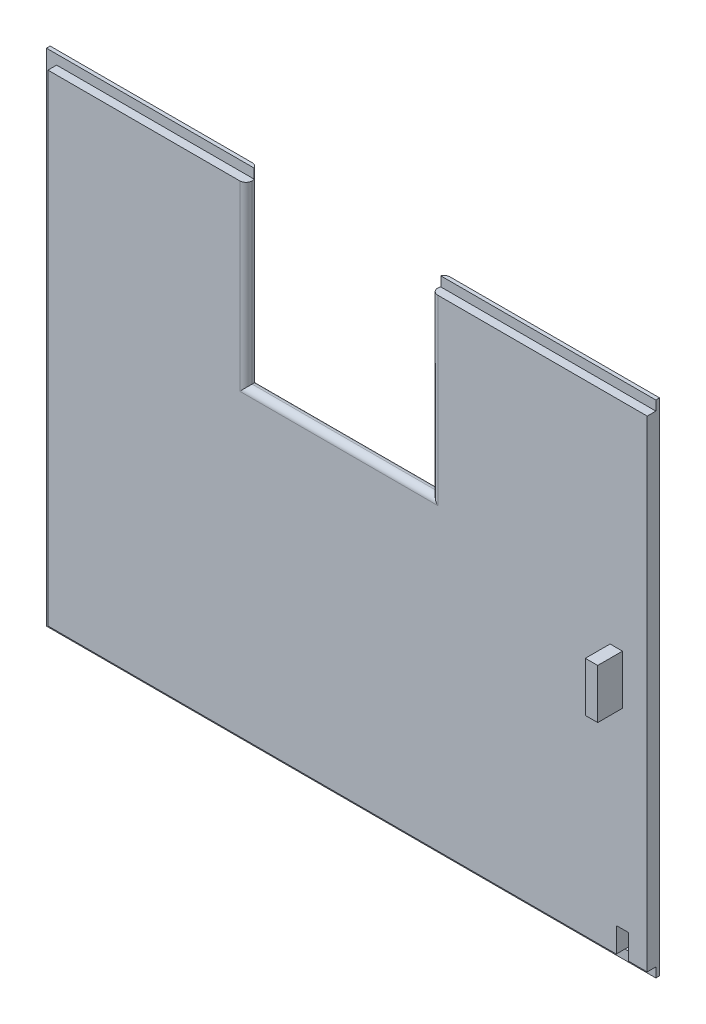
ISO-10303-21;
HEADER;
FILE_DESCRIPTION(('STEP AP214'),'2;1');
FILE_NAME('part.step','',(''),(''),'','','');
FILE_SCHEMA(('AUTOMOTIVE_DESIGN { 1 0 10303 214 1 1 1 1 }'));
ENDSEC;
DATA;
#1=APPLICATION_CONTEXT('core data for automotive mechanical design processes');
#2=APPLICATION_PROTOCOL_DEFINITION('international standard','automotive_design',2000,#1);
#3=PRODUCT_CONTEXT('',#1,'mechanical');
#4=PRODUCT('Part','Part','',(#3));
#5=PRODUCT_RELATED_PRODUCT_CATEGORY('part','',(#4));
#6=PRODUCT_DEFINITION_FORMATION('','',#4);
#7=PRODUCT_DEFINITION_CONTEXT('part definition',#1,'design');
#8=PRODUCT_DEFINITION('design','',#6,#7);
#9=PRODUCT_DEFINITION_SHAPE('','',#8);
#10=(LENGTH_UNIT() NAMED_UNIT(*) SI_UNIT(.MILLI.,.METRE.));
#11=(NAMED_UNIT(*) PLANE_ANGLE_UNIT() SI_UNIT($,.RADIAN.));
#12=(NAMED_UNIT(*) SI_UNIT($,.STERADIAN.) SOLID_ANGLE_UNIT());
#13=UNCERTAINTY_MEASURE_WITH_UNIT(LENGTH_MEASURE(1.E-05),#10,'distance_accuracy_value','');
#14=(GEOMETRIC_REPRESENTATION_CONTEXT(3) GLOBAL_UNCERTAINTY_ASSIGNED_CONTEXT((#13)) GLOBAL_UNIT_ASSIGNED_CONTEXT((#10,
#11,#12)) REPRESENTATION_CONTEXT('',''));
#15=CARTESIAN_POINT('',(0.,0.,0.));
#16=DIRECTION('',(0.,0.,1.));
#17=DIRECTION('',(1.,0.,0.));
#18=AXIS2_PLACEMENT_3D('',#15,#16,#17);
#19=CARTESIAN_POINT('',(-0.001000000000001,1.55,2.));
#20=DIRECTION('',(0.,1.,0.));
#21=DIRECTION('',(0.,0.,1.));
#22=AXIS2_PLACEMENT_3D('',#19,#20,#21);
#23=PLANE('',#22);
#24=DIRECTION('',(1.,0.,0.));
#25=VECTOR('',#24,1.);
#26=CARTESIAN_POINT('',(-0.001000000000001,1.55,0.6));
#27=LINE('',#26,#25);
#28=CARTESIAN_POINT('',(1.65,1.55,0.6));
#29=VERTEX_POINT('',#28);
#30=CARTESIAN_POINT('',(93.5,1.55,0.6));
#31=VERTEX_POINT('',#30);
#32=EDGE_CURVE('E385',#29,#31,#27,.T.);
#33=ORIENTED_EDGE('',*,*,#32,.T.);
#34=DIRECTION('',(0.,0.,1.));
#35=VECTOR('',#34,1.);
#36=CARTESIAN_POINT('',(93.5,1.55,2.));
#37=LINE('',#36,#35);
#38=CARTESIAN_POINT('',(93.5,1.55,2.));
#39=VERTEX_POINT('',#38);
#40=EDGE_CURVE('E429',#31,#39,#37,.T.);
#41=ORIENTED_EDGE('',*,*,#40,.T.);
#42=DIRECTION('',(1.,0.,0.));
#43=VECTOR('',#42,1.);
#44=CARTESIAN_POINT('',(-0.001000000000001,1.55,2.));
#45=LINE('',#44,#43);
#46=CARTESIAN_POINT('',(1.65,1.55,2.));
#47=VERTEX_POINT('',#46);
#48=EDGE_CURVE('E356',#47,#39,#45,.T.);
#49=ORIENTED_EDGE('',*,*,#48,.F.);
#50=DIRECTION('',(0.,0.,1.));
#51=VECTOR('',#50,1.);
#52=CARTESIAN_POINT('',(1.65,1.55,2.));
#53=LINE('',#52,#51);
#54=EDGE_CURVE('E339',#29,#47,#53,.T.);
#55=ORIENTED_EDGE('',*,*,#54,.F.);
#56=EDGE_LOOP('',(#33,#41,#49,#55));
#57=FACE_BOUND('',#56,.T.);
#58=ADVANCED_FACE('F39',(#57),#23,.F.);
#59=CARTESIAN_POINT('',(0.,80.9,2.));
#60=DIRECTION('',(0.,-1.,0.));
#61=DIRECTION('',(0.,0.,-1.));
#62=AXIS2_PLACEMENT_3D('',#59,#60,#61);
#63=PLANE('',#62);
#64=DIRECTION('',(1.,0.,0.));
#65=VECTOR('',#64,1.);
#66=CARTESIAN_POINT('',(-0.001000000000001,80.9,0.6));
#67=LINE('',#66,#65);
#68=CARTESIAN_POINT('',(0.,80.9,0.6));
#69=VERTEX_POINT('',#68);
#70=CARTESIAN_POINT('',(33.5665151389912,80.9,0.6));
#71=VERTEX_POINT('',#70);
#72=EDGE_CURVE('E363',#69,#71,#67,.T.);
#73=ORIENTED_EDGE('',*,*,#72,.T.);
#74=CARTESIAN_POINT('',(32.65,80.9,1.));
#75=DIRECTION('',(0.,-1.,0.));
#76=DIRECTION('',(0.,0.,-1.));
#77=AXIS2_PLACEMENT_3D('',#74,#75,#76);
#78=CIRCLE('',#77,1.);
#79=CARTESIAN_POINT('',(32.65,80.9,0.));
#80=VERTEX_POINT('',#79);
#81=EDGE_CURVE('E441',#71,#80,#78,.F.);
#82=ORIENTED_EDGE('',*,*,#81,.T.);
#83=DIRECTION('',(-1.,0.,0.));
#84=VECTOR('',#83,1.);
#85=CARTESIAN_POINT('',(0.,80.9,0.));
#86=LINE('',#85,#84);
#87=CARTESIAN_POINT('',(0.,80.9,0.));
#88=VERTEX_POINT('',#87);
#89=EDGE_CURVE('E410',#80,#88,#86,.T.);
#90=ORIENTED_EDGE('',*,*,#89,.T.);
#91=DIRECTION('',(0.,0.,-1.));
#92=VECTOR('',#91,1.);
#93=CARTESIAN_POINT('',(0.,80.9,2.));
#94=LINE('',#93,#92);
#95=EDGE_CURVE('E397',#69,#88,#94,.T.);
#96=ORIENTED_EDGE('',*,*,#95,.F.);
#97=EDGE_LOOP('',(#73,#82,#90,#96));
#98=FACE_BOUND('',#97,.T.);
#99=ADVANCED_FACE('F517',(#98),#63,.F.);
#100=CARTESIAN_POINT('',(-0.001000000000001,80.9,0.6));
#101=DIRECTION('',(0.,0.,-1.));
#102=DIRECTION('',(0.,1.,0.));
#103=AXIS2_PLACEMENT_3D('',#100,#101,#102);
#104=PLANE('',#103);
#105=DIRECTION('',(1.,0.,0.));
#106=VECTOR('',#105,1.);
#107=CARTESIAN_POINT('',(-0.001000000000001,79.35,0.6));
#108=LINE('',#107,#106);
#109=CARTESIAN_POINT('',(1.65,79.35,0.6));
#110=VERTEX_POINT('',#109);
#111=CARTESIAN_POINT('',(33.5665151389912,79.35,0.6));
#112=VERTEX_POINT('',#111);
#113=EDGE_CURVE('E227',#110,#112,#108,.T.);
#114=ORIENTED_EDGE('',*,*,#113,.T.);
#115=DIRECTION('',(0.,-1.,0.));
#116=VECTOR('',#115,1.);
#117=CARTESIAN_POINT('',(33.5665151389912,79.35,0.6));
#118=LINE('',#117,#116);
#119=EDGE_CURVE('E438',#112,#71,#118,.F.);
#120=ORIENTED_EDGE('',*,*,#119,.T.);
#121=ORIENTED_EDGE('',*,*,#72,.F.);
#122=DIRECTION('',(0.,-1.,0.));
#123=VECTOR('',#122,1.);
#124=CARTESIAN_POINT('',(0.,80.9,0.6));
#125=LINE('',#124,#123);
#126=CARTESIAN_POINT('',(0.,0.,0.6));
#127=VERTEX_POINT('',#126);
#128=EDGE_CURVE('E353',#69,#127,#125,.T.);
#129=ORIENTED_EDGE('',*,*,#128,.T.);
#130=DIRECTION('',(1.,0.,0.));
#131=VECTOR('',#130,1.);
#132=CARTESIAN_POINT('',(-0.001000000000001,0.,0.6));
#133=LINE('',#132,#131);
#134=CARTESIAN_POINT('',(98.5,0.,0.6));
#135=VERTEX_POINT('',#134);
#136=EDGE_CURVE('E380',#127,#135,#133,.T.);
#137=ORIENTED_EDGE('',*,*,#136,.T.);
#138=DIRECTION('',(0.,1.,0.));
#139=VECTOR('',#138,1.);
#140=CARTESIAN_POINT('',(98.5,0.,0.6));
#141=LINE('',#140,#139);
#142=CARTESIAN_POINT('',(98.5,1.55,0.6));
#143=VERTEX_POINT('',#142);
#144=EDGE_CURVE('E350',#135,#143,#141,.T.);
#145=ORIENTED_EDGE('',*,*,#144,.T.);
#146=CARTESIAN_POINT('',(95.5,1.55,0.6));
#147=VERTEX_POINT('',#146);
#148=EDGE_CURVE('E390',#147,#143,#27,.T.);
#149=ORIENTED_EDGE('',*,*,#148,.F.);
#150=EDGE_CURVE('E389',#31,#147,#27,.T.);
#151=ORIENTED_EDGE('',*,*,#150,.F.);
#152=ORIENTED_EDGE('',*,*,#32,.F.);
#153=DIRECTION('',(0.,1.,0.));
#154=VECTOR('',#153,1.);
#155=CARTESIAN_POINT('',(1.65,-0.001000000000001,0.6));
#156=LINE('',#155,#154);
#157=EDGE_CURVE('E347',#29,#110,#156,.T.);
#158=ORIENTED_EDGE('',*,*,#157,.T.);
#159=EDGE_LOOP('',(#114,#120,#121,#129,#137,#145,#149,#151,#152,#158));
#160=FACE_BOUND('',#159,.T.);
#161=ADVANCED_FACE('F494',(#160),#104,.F.);
#162=CARTESIAN_POINT('',(-0.001000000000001,79.35,2.));
#163=DIRECTION('',(0.,-1.,0.));
#164=DIRECTION('',(0.,0.,-1.));
#165=AXIS2_PLACEMENT_3D('',#162,#163,#164);
#166=PLANE('',#165);
#167=CARTESIAN_POINT('',(32.65,79.35,1.));
#168=DIRECTION('',(0.,-1.,0.));
#169=DIRECTION('',(0.,0.,-1.));
#170=AXIS2_PLACEMENT_3D('',#167,#168,#169);
#171=CIRCLE('',#170,1.);
#172=CARTESIAN_POINT('',(32.65,79.35,2.));
#173=VERTEX_POINT('',#172);
#174=CARTESIAN_POINT('',(33.65,79.35,1.));
#175=VERTEX_POINT('',#174);
#176=EDGE_CURVE('E432',#173,#175,#171,.F.);
#177=ORIENTED_EDGE('',*,*,#176,.T.);
#178=CARTESIAN_POINT('',(32.65,79.35,1.));
#179=DIRECTION('',(0.,-1.,0.));
#180=DIRECTION('',(0.,0.,-1.));
#181=AXIS2_PLACEMENT_3D('',#178,#179,#180);
#182=CIRCLE('',#181,1.);
#183=EDGE_CURVE('E435',#175,#112,#182,.F.);
#184=ORIENTED_EDGE('',*,*,#183,.T.);
#185=ORIENTED_EDGE('',*,*,#113,.F.);
#186=DIRECTION('',(0.,0.,-1.));
#187=VECTOR('',#186,1.);
#188=CARTESIAN_POINT('',(1.65,79.35,2.));
#189=LINE('',#188,#187);
#190=CARTESIAN_POINT('',(1.65,79.35,2.));
#191=VERTEX_POINT('',#190);
#192=EDGE_CURVE('E342',#191,#110,#189,.T.);
#193=ORIENTED_EDGE('',*,*,#192,.F.);
#194=DIRECTION('',(1.,0.,0.));
#195=VECTOR('',#194,1.);
#196=CARTESIAN_POINT('',(-0.001000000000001,79.35,2.));
#197=LINE('',#196,#195);
#198=EDGE_CURVE('E228',#191,#173,#197,.T.);
#199=ORIENTED_EDGE('',*,*,#198,.T.);
#200=EDGE_LOOP('',(#177,#184,#185,#193,#199));
#201=FACE_BOUND('',#200,.T.);
#202=ADVANCED_FACE('F472',(#201),#166,.F.);
#203=CARTESIAN_POINT('',(0.,0.,2.));
#204=DIRECTION('',(1.,0.,0.));
#205=DIRECTION('',(0.,0.,-1.));
#206=AXIS2_PLACEMENT_3D('',#203,#204,#205);
#207=PLANE('',#206);
#208=DIRECTION('',(0.,0.,-1.));
#209=VECTOR('',#208,1.);
#210=CARTESIAN_POINT('',(0.,0.,2.));
#211=LINE('',#210,#209);
#212=CARTESIAN_POINT('',(0.,0.,0.));
#213=VERTEX_POINT('',#212);
#214=EDGE_CURVE('E422',#127,#213,#211,.T.);
#215=ORIENTED_EDGE('',*,*,#214,.F.);
#216=ORIENTED_EDGE('',*,*,#128,.F.);
#217=ORIENTED_EDGE('',*,*,#95,.T.);
#218=DIRECTION('',(0.,-1.,0.));
#219=VECTOR('',#218,1.);
#220=CARTESIAN_POINT('',(0.,0.,0.));
#221=LINE('',#220,#219);
#222=EDGE_CURVE('E366',#88,#213,#221,.T.);
#223=ORIENTED_EDGE('',*,*,#222,.T.);
#224=EDGE_LOOP('',(#215,#216,#217,#223));
#225=FACE_BOUND('',#224,.T.);
#226=ADVANCED_FACE('F525',(#225),#207,.F.);
#227=CARTESIAN_POINT('',(0.,0.,2.));
#228=DIRECTION('',(0.,1.,0.));
#229=DIRECTION('',(0.,0.,1.));
#230=AXIS2_PLACEMENT_3D('',#227,#228,#229);
#231=PLANE('',#230);
#232=DIRECTION('',(0.,0.,-1.));
#233=VECTOR('',#232,1.);
#234=CARTESIAN_POINT('',(98.5,0.,2.));
#235=LINE('',#234,#233);
#236=CARTESIAN_POINT('',(98.5,0.,0.));
#237=VERTEX_POINT('',#236);
#238=EDGE_CURVE('E419',#135,#237,#235,.T.);
#239=ORIENTED_EDGE('',*,*,#238,.F.);
#240=ORIENTED_EDGE('',*,*,#136,.F.);
#241=ORIENTED_EDGE('',*,*,#214,.T.);
#242=DIRECTION('',(1.,0.,0.));
#243=VECTOR('',#242,1.);
#244=CARTESIAN_POINT('',(0.,0.,0.));
#245=LINE('',#244,#243);
#246=EDGE_CURVE('E402',#213,#237,#245,.T.);
#247=ORIENTED_EDGE('',*,*,#246,.T.);
#248=EDGE_LOOP('',(#239,#240,#241,#247));
#249=FACE_BOUND('',#248,.T.);
#250=ADVANCED_FACE('F532',(#249),#231,.F.);
#251=CARTESIAN_POINT('',(98.5,0.,2.));
#252=DIRECTION('',(-1.,0.,0.));
#253=DIRECTION('',(0.,0.,1.));
#254=AXIS2_PLACEMENT_3D('',#251,#252,#253);
#255=PLANE('',#254);
#256=DIRECTION('',(0.,0.,-1.));
#257=VECTOR('',#256,1.);
#258=CARTESIAN_POINT('',(98.5,80.9,2.));
#259=LINE('',#258,#257);
#260=CARTESIAN_POINT('',(98.5,80.9,0.6));
#261=VERTEX_POINT('',#260);
#262=CARTESIAN_POINT('',(98.5,80.9,0.));
#263=VERTEX_POINT('',#262);
#264=EDGE_CURVE('E416',#261,#263,#259,.T.);
#265=ORIENTED_EDGE('',*,*,#264,.F.);
#266=DIRECTION('',(0.,1.,0.));
#267=VECTOR('',#266,1.);
#268=CARTESIAN_POINT('',(98.5,80.9,0.6));
#269=LINE('',#268,#267);
#270=CARTESIAN_POINT('',(98.5,79.35,0.6));
#271=VERTEX_POINT('',#270);
#272=EDGE_CURVE('E359',#271,#261,#269,.T.);
#273=ORIENTED_EDGE('',*,*,#272,.F.);
#274=DIRECTION('',(0.,0.,-1.));
#275=VECTOR('',#274,1.);
#276=CARTESIAN_POINT('',(98.5,79.35,2.));
#277=LINE('',#276,#275);
#278=CARTESIAN_POINT('',(98.5,79.35,2.));
#279=VERTEX_POINT('',#278);
#280=EDGE_CURVE('E224',#279,#271,#277,.T.);
#281=ORIENTED_EDGE('',*,*,#280,.F.);
#282=DIRECTION('',(0.,1.,0.));
#283=VECTOR('',#282,1.);
#284=CARTESIAN_POINT('',(98.5,0.,2.));
#285=LINE('',#284,#283);
#286=CARTESIAN_POINT('',(98.5,1.55,2.));
#287=VERTEX_POINT('',#286);
#288=EDGE_CURVE('E393',#287,#279,#285,.T.);
#289=ORIENTED_EDGE('',*,*,#288,.F.);
#290=DIRECTION('',(0.,0.,1.));
#291=VECTOR('',#290,1.);
#292=CARTESIAN_POINT('',(98.5,1.55,2.));
#293=LINE('',#292,#291);
#294=EDGE_CURVE('E376',#143,#287,#293,.T.);
#295=ORIENTED_EDGE('',*,*,#294,.F.);
#296=ORIENTED_EDGE('',*,*,#144,.F.);
#297=ORIENTED_EDGE('',*,*,#238,.T.);
#298=DIRECTION('',(0.,1.,0.));
#299=VECTOR('',#298,1.);
#300=CARTESIAN_POINT('',(98.5,0.,0.));
#301=LINE('',#300,#299);
#302=EDGE_CURVE('E406',#237,#263,#301,.T.);
#303=ORIENTED_EDGE('',*,*,#302,.T.);
#304=EDGE_LOOP('',(#265,#273,#281,#289,#295,#296,#297,#303));
#305=FACE_BOUND('',#304,.T.);
#306=ADVANCED_FACE('F507',(#305),#255,.F.);
#307=CARTESIAN_POINT('',(64.65,80.9,0.));
#308=VERTEX_POINT('',#307);
#309=EDGE_CURVE('E398',#263,#308,#86,.T.);
#310=ORIENTED_EDGE('',*,*,#309,.T.);
#311=CARTESIAN_POINT('',(64.65,80.9,1.));
#312=DIRECTION('',(0.,-1.,0.));
#313=DIRECTION('',(0.,0.,-1.));
#314=AXIS2_PLACEMENT_3D('',#311,#312,#313);
#315=CIRCLE('',#314,1.);
#316=CARTESIAN_POINT('',(63.7334848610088,80.9,0.6));
#317=VERTEX_POINT('',#316);
#318=EDGE_CURVE('E50',#308,#317,#315,.F.);
#319=ORIENTED_EDGE('',*,*,#318,.T.);
#320=EDGE_CURVE('E217',#317,#261,#67,.T.);
#321=ORIENTED_EDGE('',*,*,#320,.T.);
#322=ORIENTED_EDGE('',*,*,#264,.T.);
#323=EDGE_LOOP('',(#310,#319,#321,#322));
#324=FACE_BOUND('',#323,.T.);
#325=ADVANCED_FACE('F534',(#324),#63,.F.);
#326=CARTESIAN_POINT('',(0.,0.,2.));
#327=DIRECTION('',(0.,0.,-1.));
#328=DIRECTION('',(-1.,0.,0.));
#329=AXIS2_PLACEMENT_3D('',#326,#327,#328);
#330=PLANE('',#329);
#331=DIRECTION('',(1.,0.,0.));
#332=VECTOR('',#331,1.);
#333=CARTESIAN_POINT('',(0.,44.45,2.));
#334=LINE('',#333,#332);
#335=CARTESIAN_POINT('',(92.5,44.45,2.));
#336=VERTEX_POINT('',#335);
#337=CARTESIAN_POINT('',(94.5,44.45,2.));
#338=VERTEX_POINT('',#337);
#339=EDGE_CURVE('E331',#336,#338,#334,.T.);
#340=ORIENTED_EDGE('',*,*,#339,.T.);
#341=DIRECTION('',(0.,-1.,0.));
#342=VECTOR('',#341,1.);
#343=CARTESIAN_POINT('',(94.5,0.,2.));
#344=LINE('',#343,#342);
#345=CARTESIAN_POINT('',(94.5,36.45,2.));
#346=VERTEX_POINT('',#345);
#347=EDGE_CURVE('E335',#338,#346,#344,.T.);
#348=ORIENTED_EDGE('',*,*,#347,.T.);
#349=DIRECTION('',(-1.,0.,0.));
#350=VECTOR('',#349,1.);
#351=CARTESIAN_POINT('',(0.,36.45,2.));
#352=LINE('',#351,#350);
#353=CARTESIAN_POINT('',(92.5,36.45,2.));
#354=VERTEX_POINT('',#353);
#355=EDGE_CURVE('E313',#346,#354,#352,.T.);
#356=ORIENTED_EDGE('',*,*,#355,.T.);
#357=DIRECTION('',(0.,1.,0.));
#358=VECTOR('',#357,1.);
#359=CARTESIAN_POINT('',(92.5,0.,2.));
#360=LINE('',#359,#358);
#361=EDGE_CURVE('E327',#354,#336,#360,.T.);
#362=ORIENTED_EDGE('',*,*,#361,.T.);
#363=EDGE_LOOP('',(#340,#348,#356,#362));
#364=FACE_BOUND('',#363,.T.);
#365=DIRECTION('',(1.,0.,0.));
#366=VECTOR('',#365,1.);
#367=CARTESIAN_POINT('',(33.65,49.9,2.));
#368=LINE('',#367,#366);
#369=CARTESIAN_POINT('',(64.65,49.9,2.));
#370=VERTEX_POINT('',#369);
#371=CARTESIAN_POINT('',(32.65,49.9,2.));
#372=VERTEX_POINT('',#371);
#373=EDGE_CURVE('E454',#370,#372,#368,.F.);
#374=ORIENTED_EDGE('',*,*,#373,.T.);
#375=DIRECTION('',(0.,1.,0.));
#376=VECTOR('',#375,1.);
#377=CARTESIAN_POINT('',(32.65,0.,2.));
#378=LINE('',#377,#376);
#379=EDGE_CURVE('E234',#372,#173,#378,.T.);
#380=ORIENTED_EDGE('',*,*,#379,.T.);
#381=ORIENTED_EDGE('',*,*,#198,.F.);
#382=DIRECTION('',(0.,1.,0.));
#383=VECTOR('',#382,1.);
#384=CARTESIAN_POINT('',(1.65,-0.001000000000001,2.));
#385=LINE('',#384,#383);
#386=EDGE_CURVE('E346',#47,#191,#385,.T.);
#387=ORIENTED_EDGE('',*,*,#386,.F.);
#388=ORIENTED_EDGE('',*,*,#48,.T.);
#389=DIRECTION('',(0.,-1.,0.));
#390=VECTOR('',#389,1.);
#391=CARTESIAN_POINT('',(93.5,1.55,2.));
#392=LINE('',#391,#390);
#393=CARTESIAN_POINT('',(93.5,5.55,2.));
#394=VERTEX_POINT('',#393);
#395=EDGE_CURVE('E85',#394,#39,#392,.T.);
#396=ORIENTED_EDGE('',*,*,#395,.F.);
#397=DIRECTION('',(-1.,0.,0.));
#398=VECTOR('',#397,1.);
#399=CARTESIAN_POINT('',(93.5,5.55,2.));
#400=LINE('',#399,#398);
#401=CARTESIAN_POINT('',(95.5,5.55,2.));
#402=VERTEX_POINT('',#401);
#403=EDGE_CURVE('E269',#402,#394,#400,.T.);
#404=ORIENTED_EDGE('',*,*,#403,.F.);
#405=DIRECTION('',(0.,1.,0.));
#406=VECTOR('',#405,1.);
#407=CARTESIAN_POINT('',(95.5,1.55,2.));
#408=LINE('',#407,#406);
#409=CARTESIAN_POINT('',(95.5,1.55,2.));
#410=VERTEX_POINT('',#409);
#411=EDGE_CURVE('E265',#410,#402,#408,.T.);
#412=ORIENTED_EDGE('',*,*,#411,.F.);
#413=EDGE_CURVE('E384',#410,#287,#45,.T.);
#414=ORIENTED_EDGE('',*,*,#413,.T.);
#415=ORIENTED_EDGE('',*,*,#288,.T.);
#416=CARTESIAN_POINT('',(64.65,79.35,2.));
#417=VERTEX_POINT('',#416);
#418=EDGE_CURVE('E362',#417,#279,#197,.T.);
#419=ORIENTED_EDGE('',*,*,#418,.F.);
#420=DIRECTION('',(0.,1.,0.));
#421=VECTOR('',#420,1.);
#422=CARTESIAN_POINT('',(64.65,0.,2.));
#423=LINE('',#422,#421);
#424=EDGE_CURVE('E239',#417,#370,#423,.F.);
#425=ORIENTED_EDGE('',*,*,#424,.T.);
#426=EDGE_LOOP('',(#374,#380,#381,#387,#388,#396,#404,#412,#414,#415,#419,#425));
#427=FACE_BOUND('',#426,.T.);
#428=ADVANCED_FACE('F460',(#364,#427),#330,.F.);
#429=CARTESIAN_POINT('',(0.,0.,0.));
#430=DIRECTION('',(0.,0.,-1.));
#431=DIRECTION('',(-1.,0.,0.));
#432=AXIS2_PLACEMENT_3D('',#429,#430,#431);
#433=PLANE('',#432);
#434=ORIENTED_EDGE('',*,*,#89,.F.);
#435=DIRECTION('',(0.,1.,0.));
#436=VECTOR('',#435,1.);
#437=CARTESIAN_POINT('',(32.65,50.9,0.));
#438=LINE('',#437,#436);
#439=CARTESIAN_POINT('',(32.65,49.9,0.));
#440=VERTEX_POINT('',#439);
#441=EDGE_CURVE('E450',#80,#440,#438,.F.);
#442=ORIENTED_EDGE('',*,*,#441,.T.);
#443=DIRECTION('',(-1.,0.,0.));
#444=VECTOR('',#443,1.);
#445=CARTESIAN_POINT('',(0.,49.9,0.));
#446=LINE('',#445,#444);
#447=CARTESIAN_POINT('',(64.65,49.9,0.));
#448=VERTEX_POINT('',#447);
#449=EDGE_CURVE('E444',#440,#448,#446,.F.);
#450=ORIENTED_EDGE('',*,*,#449,.T.);
#451=DIRECTION('',(0.,1.,0.));
#452=VECTOR('',#451,1.);
#453=CARTESIAN_POINT('',(64.65,80.9,0.));
#454=LINE('',#453,#452);
#455=EDGE_CURVE('E447',#448,#308,#454,.T.);
#456=ORIENTED_EDGE('',*,*,#455,.T.);
#457=ORIENTED_EDGE('',*,*,#309,.F.);
#458=ORIENTED_EDGE('',*,*,#302,.F.);
#459=ORIENTED_EDGE('',*,*,#246,.F.);
#460=ORIENTED_EDGE('',*,*,#222,.F.);
#461=EDGE_LOOP('',(#434,#442,#450,#456,#457,#458,#459,#460));
#462=FACE_BOUND('',#461,.T.);
#463=DIRECTION('',(0.,-1.,0.));
#464=VECTOR('',#463,1.);
#465=CARTESIAN_POINT('',(93.5,1.55,0.));
#466=LINE('',#465,#464);
#467=CARTESIAN_POINT('',(93.5,5.55,0.));
#468=VERTEX_POINT('',#467);
#469=CARTESIAN_POINT('',(93.5,1.55,0.));
#470=VERTEX_POINT('',#469);
#471=EDGE_CURVE('E278',#468,#470,#466,.T.);
#472=ORIENTED_EDGE('',*,*,#471,.T.);
#473=DIRECTION('',(1.,0.,0.));
#474=VECTOR('',#473,1.);
#475=CARTESIAN_POINT('',(93.5,1.55,0.));
#476=LINE('',#475,#474);
#477=CARTESIAN_POINT('',(95.5,1.55,0.));
#478=VERTEX_POINT('',#477);
#479=EDGE_CURVE('E490',#470,#478,#476,.T.);
#480=ORIENTED_EDGE('',*,*,#479,.T.);
#481=DIRECTION('',(0.,1.,0.));
#482=VECTOR('',#481,1.);
#483=CARTESIAN_POINT('',(95.5,1.55,0.));
#484=LINE('',#483,#482);
#485=CARTESIAN_POINT('',(95.5,5.55,0.));
#486=VERTEX_POINT('',#485);
#487=EDGE_CURVE('E627',#478,#486,#484,.T.);
#488=ORIENTED_EDGE('',*,*,#487,.T.);
#489=DIRECTION('',(-1.,0.,0.));
#490=VECTOR('',#489,1.);
#491=CARTESIAN_POINT('',(93.5,5.55,0.));
#492=LINE('',#491,#490);
#493=EDGE_CURVE('E272',#486,#468,#492,.T.);
#494=ORIENTED_EDGE('',*,*,#493,.T.);
#495=EDGE_LOOP('',(#472,#480,#488,#494));
#496=FACE_BOUND('',#495,.T.);
#497=ADVANCED_FACE('F527',(#462,#496),#433,.T.);
#498=ORIENTED_EDGE('',*,*,#413,.F.);
#499=DIRECTION('',(0.,0.,-1.));
#500=VECTOR('',#499,1.);
#501=CARTESIAN_POINT('',(95.5,1.55,2.));
#502=LINE('',#501,#500);
#503=EDGE_CURVE('E425',#410,#147,#502,.T.);
#504=ORIENTED_EDGE('',*,*,#503,.T.);
#505=ORIENTED_EDGE('',*,*,#148,.T.);
#506=ORIENTED_EDGE('',*,*,#294,.T.);
#507=EDGE_LOOP('',(#498,#504,#505,#506));
#508=FACE_BOUND('',#507,.T.);
#509=ADVANCED_FACE('F499',(#508),#23,.F.);
#510=ORIENTED_EDGE('',*,*,#320,.F.);
#511=DIRECTION('',(0.,-1.,0.));
#512=VECTOR('',#511,1.);
#513=CARTESIAN_POINT('',(63.7334848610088,80.9,0.6));
#514=LINE('',#513,#512);
#515=CARTESIAN_POINT('',(63.7334848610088,79.35,0.6));
#516=VERTEX_POINT('',#515);
#517=EDGE_CURVE('E11',#317,#516,#514,.T.);
#518=ORIENTED_EDGE('',*,*,#517,.T.);
#519=EDGE_CURVE('E215',#516,#271,#108,.T.);
#520=ORIENTED_EDGE('',*,*,#519,.T.);
#521=ORIENTED_EDGE('',*,*,#272,.T.);
#522=EDGE_LOOP('',(#510,#518,#520,#521));
#523=FACE_BOUND('',#522,.T.);
#524=ADVANCED_FACE('F213',(#523),#104,.F.);
#525=CARTESIAN_POINT('',(64.65,79.35,1.));
#526=DIRECTION('',(0.,-1.,0.));
#527=DIRECTION('',(0.,0.,-1.));
#528=AXIS2_PLACEMENT_3D('',#525,#526,#527);
#529=CIRCLE('',#528,1.);
#530=CARTESIAN_POINT('',(63.65,79.35,1.));
#531=VERTEX_POINT('',#530);
#532=EDGE_CURVE('E222',#516,#531,#529,.F.);
#533=ORIENTED_EDGE('',*,*,#532,.T.);
#534=CARTESIAN_POINT('',(64.65,79.35,1.));
#535=DIRECTION('',(0.,-1.,0.));
#536=DIRECTION('',(0.,0.,-1.));
#537=AXIS2_PLACEMENT_3D('',#534,#535,#536);
#538=CIRCLE('',#537,1.);
#539=EDGE_CURVE('E233',#531,#417,#538,.F.);
#540=ORIENTED_EDGE('',*,*,#539,.T.);
#541=ORIENTED_EDGE('',*,*,#418,.T.);
#542=ORIENTED_EDGE('',*,*,#280,.T.);
#543=ORIENTED_EDGE('',*,*,#519,.F.);
#544=EDGE_LOOP('',(#533,#540,#541,#542,#543));
#545=FACE_BOUND('',#544,.T.);
#546=ADVANCED_FACE('F221',(#545),#166,.F.);
#547=CARTESIAN_POINT('',(1.65,-0.001000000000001,2.));
#548=DIRECTION('',(1.,0.,0.));
#549=DIRECTION('',(0.,0.,-1.));
#550=AXIS2_PLACEMENT_3D('',#547,#548,#549);
#551=PLANE('',#550);
#552=ORIENTED_EDGE('',*,*,#54,.T.);
#553=ORIENTED_EDGE('',*,*,#386,.T.);
#554=ORIENTED_EDGE('',*,*,#192,.T.);
#555=ORIENTED_EDGE('',*,*,#157,.F.);
#556=EDGE_LOOP('',(#552,#553,#554,#555));
#557=FACE_BOUND('',#556,.T.);
#558=ADVANCED_FACE('F475',(#557),#551,.F.);
#559=CARTESIAN_POINT('',(94.5,44.45,6.));
#560=DIRECTION('',(1.,0.,0.));
#561=DIRECTION('',(0.,0.,-1.));
#562=AXIS2_PLACEMENT_3D('',#559,#560,#561);
#563=PLANE('',#562);
#564=ORIENTED_EDGE('',*,*,#347,.F.);
#565=DIRECTION('',(0.,0.,-1.));
#566=VECTOR('',#565,1.);
#567=CARTESIAN_POINT('',(94.5,44.45,6.));
#568=LINE('',#567,#566);
#569=CARTESIAN_POINT('',(94.5,44.45,6.));
#570=VERTEX_POINT('',#569);
#571=EDGE_CURVE('E309',#570,#338,#568,.T.);
#572=ORIENTED_EDGE('',*,*,#571,.F.);
#573=DIRECTION('',(0.,-1.,0.));
#574=VECTOR('',#573,1.);
#575=CARTESIAN_POINT('',(94.5,44.45,6.));
#576=LINE('',#575,#574);
#577=CARTESIAN_POINT('',(94.5,36.45,6.));
#578=VERTEX_POINT('',#577);
#579=EDGE_CURVE('E282',#570,#578,#576,.T.);
#580=ORIENTED_EDGE('',*,*,#579,.T.);
#581=DIRECTION('',(0.,0.,-1.));
#582=VECTOR('',#581,1.);
#583=CARTESIAN_POINT('',(94.5,36.45,6.));
#584=LINE('',#583,#582);
#585=EDGE_CURVE('E308',#578,#346,#584,.T.);
#586=ORIENTED_EDGE('',*,*,#585,.T.);
#587=EDGE_LOOP('',(#564,#572,#580,#586));
#588=FACE_BOUND('',#587,.T.);
#589=ADVANCED_FACE('F584',(#588),#563,.T.);
#590=CARTESIAN_POINT('',(94.5,44.45,6.));
#591=DIRECTION('',(0.,1.,0.));
#592=DIRECTION('',(0.,0.,1.));
#593=AXIS2_PLACEMENT_3D('',#590,#591,#592);
#594=PLANE('',#593);
#595=ORIENTED_EDGE('',*,*,#339,.F.);
#596=DIRECTION('',(0.,0.,-1.));
#597=VECTOR('',#596,1.);
#598=CARTESIAN_POINT('',(92.5,44.45,6.));
#599=LINE('',#598,#597);
#600=CARTESIAN_POINT('',(92.5,44.45,6.));
#601=VERTEX_POINT('',#600);
#602=EDGE_CURVE('E314',#601,#336,#599,.T.);
#603=ORIENTED_EDGE('',*,*,#602,.F.);
#604=DIRECTION('',(1.,0.,0.));
#605=VECTOR('',#604,1.);
#606=CARTESIAN_POINT('',(94.5,44.45,6.));
#607=LINE('',#606,#605);
#608=EDGE_CURVE('E304',#601,#570,#607,.T.);
#609=ORIENTED_EDGE('',*,*,#608,.T.);
#610=ORIENTED_EDGE('',*,*,#571,.T.);
#611=EDGE_LOOP('',(#595,#603,#609,#610));
#612=FACE_BOUND('',#611,.T.);
#613=ADVANCED_FACE('F589',(#612),#594,.T.);
#614=CARTESIAN_POINT('',(92.5,44.45,6.));
#615=DIRECTION('',(-1.,0.,0.));
#616=DIRECTION('',(0.,0.,1.));
#617=AXIS2_PLACEMENT_3D('',#614,#615,#616);
#618=PLANE('',#617);
#619=ORIENTED_EDGE('',*,*,#361,.F.);
#620=DIRECTION('',(0.,0.,-1.));
#621=VECTOR('',#620,1.);
#622=CARTESIAN_POINT('',(92.5,36.45,6.));
#623=LINE('',#622,#621);
#624=CARTESIAN_POINT('',(92.5,36.45,6.));
#625=VERTEX_POINT('',#624);
#626=EDGE_CURVE('E318',#625,#354,#623,.T.);
#627=ORIENTED_EDGE('',*,*,#626,.F.);
#628=DIRECTION('',(0.,1.,0.));
#629=VECTOR('',#628,1.);
#630=CARTESIAN_POINT('',(92.5,44.45,6.));
#631=LINE('',#630,#629);
#632=EDGE_CURVE('E300',#625,#601,#631,.T.);
#633=ORIENTED_EDGE('',*,*,#632,.T.);
#634=ORIENTED_EDGE('',*,*,#602,.T.);
#635=EDGE_LOOP('',(#619,#627,#633,#634));
#636=FACE_BOUND('',#635,.T.);
#637=ADVANCED_FACE('F597',(#636),#618,.T.);
#638=CARTESIAN_POINT('',(94.5,36.45,6.));
#639=DIRECTION('',(0.,-1.,0.));
#640=DIRECTION('',(0.,0.,-1.));
#641=AXIS2_PLACEMENT_3D('',#638,#639,#640);
#642=PLANE('',#641);
#643=ORIENTED_EDGE('',*,*,#355,.F.);
#644=ORIENTED_EDGE('',*,*,#585,.F.);
#645=DIRECTION('',(-1.,0.,0.));
#646=VECTOR('',#645,1.);
#647=CARTESIAN_POINT('',(94.5,36.45,6.));
#648=LINE('',#647,#646);
#649=EDGE_CURVE('E296',#578,#625,#648,.T.);
#650=ORIENTED_EDGE('',*,*,#649,.T.);
#651=ORIENTED_EDGE('',*,*,#626,.T.);
#652=EDGE_LOOP('',(#643,#644,#650,#651));
#653=FACE_BOUND('',#652,.T.);
#654=ADVANCED_FACE('F593',(#653),#642,.T.);
#655=CARTESIAN_POINT('',(0.,0.,6.));
#656=DIRECTION('',(0.,0.,-1.));
#657=DIRECTION('',(-1.,0.,0.));
#658=AXIS2_PLACEMENT_3D('',#655,#656,#657);
#659=PLANE('',#658);
#660=ORIENTED_EDGE('',*,*,#579,.F.);
#661=ORIENTED_EDGE('',*,*,#608,.F.);
#662=ORIENTED_EDGE('',*,*,#632,.F.);
#663=ORIENTED_EDGE('',*,*,#649,.F.);
#664=EDGE_LOOP('',(#660,#661,#662,#663));
#665=FACE_BOUND('',#664,.T.);
#666=ADVANCED_FACE('F596',(#665),#659,.F.);
#667=CARTESIAN_POINT('',(93.5,1.55,0.));
#668=DIRECTION('',(0.,-1.,0.));
#669=DIRECTION('',(0.,0.,-1.));
#670=AXIS2_PLACEMENT_3D('',#667,#668,#669);
#671=PLANE('',#670);
#672=DIRECTION('',(0.,0.,1.));
#673=VECTOR('',#672,1.);
#674=CARTESIAN_POINT('',(95.5,1.55,0.));
#675=LINE('',#674,#673);
#676=EDGE_CURVE('E286',#478,#147,#675,.T.);
#677=ORIENTED_EDGE('',*,*,#676,.F.);
#678=ORIENTED_EDGE('',*,*,#479,.F.);
#679=DIRECTION('',(0.,0.,1.));
#680=VECTOR('',#679,1.);
#681=CARTESIAN_POINT('',(93.5,1.55,0.));
#682=LINE('',#681,#680);
#683=EDGE_CURVE('E289',#470,#31,#682,.T.);
#684=ORIENTED_EDGE('',*,*,#683,.T.);
#685=ORIENTED_EDGE('',*,*,#150,.T.);
#686=EDGE_LOOP('',(#677,#678,#684,#685));
#687=FACE_BOUND('',#686,.T.);
#688=ADVANCED_FACE('F488',(#687),#671,.F.);
#689=CARTESIAN_POINT('',(93.5,1.55,0.));
#690=DIRECTION('',(-1.,0.,0.));
#691=DIRECTION('',(0.,0.,1.));
#692=AXIS2_PLACEMENT_3D('',#689,#690,#691);
#693=PLANE('',#692);
#694=ORIENTED_EDGE('',*,*,#395,.T.);
#695=ORIENTED_EDGE('',*,*,#40,.F.);
#696=ORIENTED_EDGE('',*,*,#683,.F.);
#697=ORIENTED_EDGE('',*,*,#471,.F.);
#698=DIRECTION('',(0.,0.,1.));
#699=VECTOR('',#698,1.);
#700=CARTESIAN_POINT('',(93.5,5.55,0.));
#701=LINE('',#700,#699);
#702=EDGE_CURVE('E279',#468,#394,#701,.T.);
#703=ORIENTED_EDGE('',*,*,#702,.T.);
#704=EDGE_LOOP('',(#694,#695,#696,#697,#703));
#705=FACE_BOUND('',#704,.T.);
#706=ADVANCED_FACE('F481',(#705),#693,.F.);
#707=CARTESIAN_POINT('',(93.5,5.55,0.));
#708=DIRECTION('',(0.,1.,0.));
#709=DIRECTION('',(0.,0.,1.));
#710=AXIS2_PLACEMENT_3D('',#707,#708,#709);
#711=PLANE('',#710);
#712=ORIENTED_EDGE('',*,*,#403,.T.);
#713=ORIENTED_EDGE('',*,*,#702,.F.);
#714=ORIENTED_EDGE('',*,*,#493,.F.);
#715=DIRECTION('',(0.,0.,1.));
#716=VECTOR('',#715,1.);
#717=CARTESIAN_POINT('',(95.5,5.55,0.));
#718=LINE('',#717,#716);
#719=EDGE_CURVE('E283',#486,#402,#718,.T.);
#720=ORIENTED_EDGE('',*,*,#719,.T.);
#721=EDGE_LOOP('',(#712,#713,#714,#720));
#722=FACE_BOUND('',#721,.T.);
#723=ADVANCED_FACE('F610',(#722),#711,.F.);
#724=CARTESIAN_POINT('',(95.5,1.55,0.));
#725=DIRECTION('',(1.,0.,0.));
#726=DIRECTION('',(0.,0.,-1.));
#727=AXIS2_PLACEMENT_3D('',#724,#725,#726);
#728=PLANE('',#727);
#729=ORIENTED_EDGE('',*,*,#411,.T.);
#730=ORIENTED_EDGE('',*,*,#719,.F.);
#731=ORIENTED_EDGE('',*,*,#487,.F.);
#732=ORIENTED_EDGE('',*,*,#676,.T.);
#733=ORIENTED_EDGE('',*,*,#503,.F.);
#734=EDGE_LOOP('',(#729,#730,#731,#732,#733));
#735=FACE_BOUND('',#734,.T.);
#736=ADVANCED_FACE('F613',(#735),#728,.F.);
#737=CARTESIAN_POINT('',(64.65,50.9,1.));
#738=DIRECTION('',(0.,1.,0.));
#739=DIRECTION('',(0.,0.,1.));
#740=AXIS2_PLACEMENT_3D('',#737,#738,#739);
#741=CYLINDRICAL_SURFACE('',#740,1.);
#742=ORIENTED_EDGE('',*,*,#424,.F.);
#743=ORIENTED_EDGE('',*,*,#539,.F.);
#744=DIRECTION('',(0.,1.,0.));
#745=VECTOR('',#744,1.);
#746=CARTESIAN_POINT('',(63.65,50.9,1.));
#747=LINE('',#746,#745);
#748=CARTESIAN_POINT('',(63.65,50.9,1.));
#749=VERTEX_POINT('',#748);
#750=EDGE_CURVE('E43',#749,#531,#747,.T.);
#751=ORIENTED_EDGE('',*,*,#750,.F.);
#752=CARTESIAN_POINT('',(64.65,49.9,1.));
#753=DIRECTION('',(0.707106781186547,0.707106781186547,0.));
#754=DIRECTION('',(-0.707106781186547,0.707106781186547,0.));
#755=AXIS2_PLACEMENT_3D('',#752,#753,#754);
#756=ELLIPSE('',#755,1.41421356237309,1.);
#757=EDGE_CURVE('E260',#370,#749,#756,.F.);
#758=ORIENTED_EDGE('',*,*,#757,.F.);
#759=EDGE_LOOP('',(#742,#743,#751,#758));
#760=FACE_BOUND('',#759,.T.);
#761=ADVANCED_FACE('F41',(#760),#741,.T.);
#762=CARTESIAN_POINT('',(64.65,0.,1.));
#763=DIRECTION('',(0.,-1.,0.));
#764=DIRECTION('',(0.,0.,-1.));
#765=AXIS2_PLACEMENT_3D('',#762,#763,#764);
#766=CYLINDRICAL_SURFACE('',#765,1.);
#767=ORIENTED_EDGE('',*,*,#318,.F.);
#768=ORIENTED_EDGE('',*,*,#455,.F.);
#769=CARTESIAN_POINT('',(64.65,49.9,1.));
#770=DIRECTION('',(-0.707106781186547,-0.707106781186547,0.));
#771=DIRECTION('',(0.707106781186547,-0.707106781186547,0.));
#772=AXIS2_PLACEMENT_3D('',#769,#770,#771);
#773=ELLIPSE('',#772,1.41421356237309,1.);
#774=EDGE_CURVE('E257',#749,#448,#773,.T.);
#775=ORIENTED_EDGE('',*,*,#774,.F.);
#776=ORIENTED_EDGE('',*,*,#750,.T.);
#777=ORIENTED_EDGE('',*,*,#532,.F.);
#778=ORIENTED_EDGE('',*,*,#517,.F.);
#779=EDGE_LOOP('',(#767,#768,#775,#776,#777,#778));
#780=FACE_BOUND('',#779,.T.);
#781=ADVANCED_FACE('F230',(#780),#766,.T.);
#782=CARTESIAN_POINT('',(0.,49.9,1.));
#783=DIRECTION('',(-1.,0.,0.));
#784=DIRECTION('',(0.,0.,1.));
#785=AXIS2_PLACEMENT_3D('',#782,#783,#784);
#786=CYLINDRICAL_SURFACE('',#785,1.);
#787=ORIENTED_EDGE('',*,*,#373,.F.);
#788=ORIENTED_EDGE('',*,*,#757,.T.);
#789=DIRECTION('',(1.,0.,0.));
#790=VECTOR('',#789,1.);
#791=CARTESIAN_POINT('',(63.65,50.9,1.));
#792=LINE('',#791,#790);
#793=CARTESIAN_POINT('',(33.65,50.9,1.));
#794=VERTEX_POINT('',#793);
#795=EDGE_CURVE('E70',#794,#749,#792,.T.);
#796=ORIENTED_EDGE('',*,*,#795,.F.);
#797=CARTESIAN_POINT('',(32.65,49.9,1.));
#798=DIRECTION('',(-0.707106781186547,0.707106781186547,0.));
#799=DIRECTION('',(0.707106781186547,0.707106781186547,0.));
#800=AXIS2_PLACEMENT_3D('',#797,#798,#799);
#801=ELLIPSE('',#800,1.41421356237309,1.);
#802=EDGE_CURVE('E252',#372,#794,#801,.T.);
#803=ORIENTED_EDGE('',*,*,#802,.F.);
#804=EDGE_LOOP('',(#787,#788,#796,#803));
#805=FACE_BOUND('',#804,.T.);
#806=ADVANCED_FACE('F461',(#805),#786,.T.);
#807=CARTESIAN_POINT('',(0.,49.9,1.));
#808=DIRECTION('',(-1.,0.,0.));
#809=DIRECTION('',(0.,0.,1.));
#810=AXIS2_PLACEMENT_3D('',#807,#808,#809);
#811=CYLINDRICAL_SURFACE('',#810,1.);
#812=ORIENTED_EDGE('',*,*,#774,.T.);
#813=ORIENTED_EDGE('',*,*,#449,.F.);
#814=CARTESIAN_POINT('',(32.65,49.9,1.));
#815=DIRECTION('',(0.707106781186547,-0.707106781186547,0.));
#816=DIRECTION('',(-0.707106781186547,-0.707106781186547,0.));
#817=AXIS2_PLACEMENT_3D('',#814,#815,#816);
#818=ELLIPSE('',#817,1.41421356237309,1.);
#819=EDGE_CURVE('E249',#794,#440,#818,.F.);
#820=ORIENTED_EDGE('',*,*,#819,.F.);
#821=ORIENTED_EDGE('',*,*,#795,.T.);
#822=EDGE_LOOP('',(#812,#813,#820,#821));
#823=FACE_BOUND('',#822,.T.);
#824=ADVANCED_FACE('F537',(#823),#811,.T.);
#825=CARTESIAN_POINT('',(32.65,0.,1.));
#826=DIRECTION('',(0.,1.,0.));
#827=DIRECTION('',(0.,0.,1.));
#828=AXIS2_PLACEMENT_3D('',#825,#826,#827);
#829=CYLINDRICAL_SURFACE('',#828,1.);
#830=ORIENTED_EDGE('',*,*,#379,.F.);
#831=ORIENTED_EDGE('',*,*,#802,.T.);
#832=DIRECTION('',(0.,1.,0.));
#833=VECTOR('',#832,1.);
#834=CARTESIAN_POINT('',(33.65,50.9,1.));
#835=LINE('',#834,#833);
#836=EDGE_CURVE('E245',#175,#794,#835,.F.);
#837=ORIENTED_EDGE('',*,*,#836,.F.);
#838=ORIENTED_EDGE('',*,*,#176,.F.);
#839=EDGE_LOOP('',(#830,#831,#837,#838));
#840=FACE_BOUND('',#839,.T.);
#841=ADVANCED_FACE('F467',(#840),#829,.T.);
#842=CARTESIAN_POINT('',(32.65,50.9,1.));
#843=DIRECTION('',(0.,-1.,0.));
#844=DIRECTION('',(0.,0.,-1.));
#845=AXIS2_PLACEMENT_3D('',#842,#843,#844);
#846=CYLINDRICAL_SURFACE('',#845,1.);
#847=ORIENTED_EDGE('',*,*,#819,.T.);
#848=ORIENTED_EDGE('',*,*,#441,.F.);
#849=ORIENTED_EDGE('',*,*,#81,.F.);
#850=ORIENTED_EDGE('',*,*,#119,.F.);
#851=ORIENTED_EDGE('',*,*,#183,.F.);
#852=ORIENTED_EDGE('',*,*,#836,.T.);
#853=EDGE_LOOP('',(#847,#848,#849,#850,#851,#852));
#854=FACE_BOUND('',#853,.T.);
#855=ADVANCED_FACE('F540',(#854),#846,.T.);
#856=CLOSED_SHELL('',(#58,#99,#161,#202,#226,#250,#306,#325,#428,#497,#509,#524,#546,#558,#589,
#613,#637,#654,#666,#688,#706,#723,#736,#761,#781,#806,#824,#841,#855));
#857=MANIFOLD_SOLID_BREP('B2',#856);
#858=ADVANCED_BREP_SHAPE_REPRESENTATION('',(#18,#857),#14);
#859=SHAPE_DEFINITION_REPRESENTATION(#9,#858);
ENDSEC;
END-ISO-10303-21;
